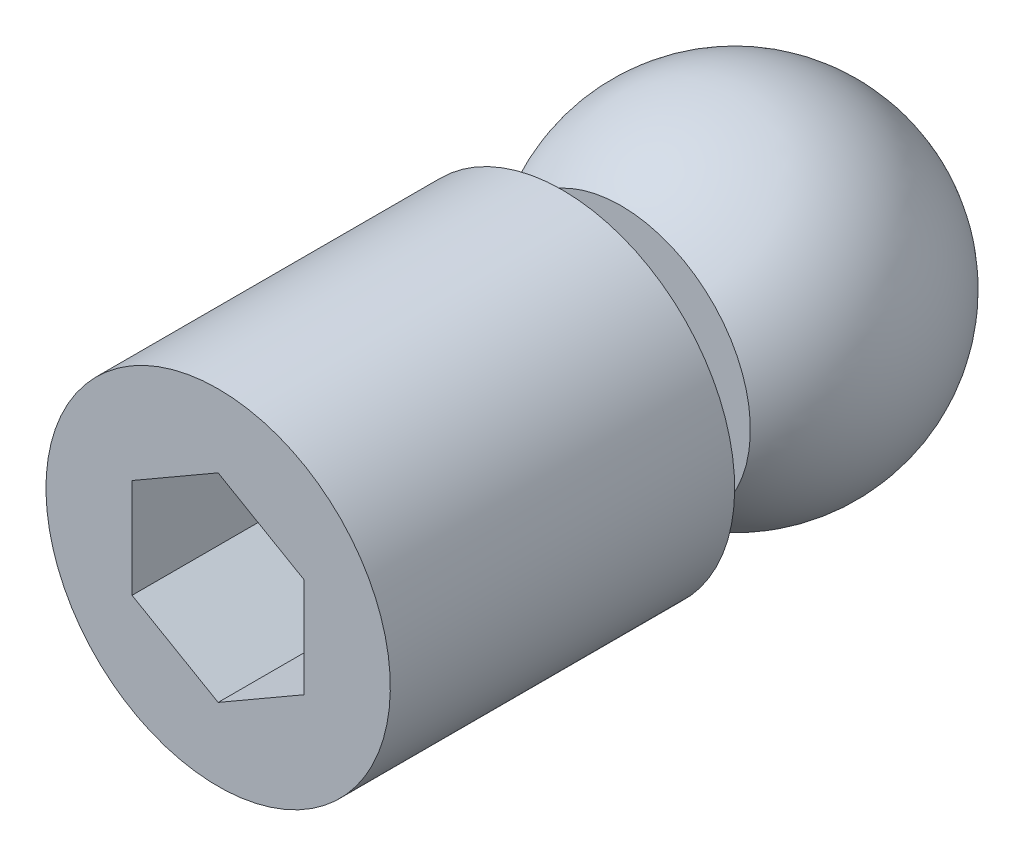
ISO-10303-21;
HEADER;
FILE_DESCRIPTION(('STEP AP214'),'2;1');
FILE_NAME('part.step','',(''),(''),'','','');
FILE_SCHEMA(('AUTOMOTIVE_DESIGN { 1 0 10303 214 1 1 1 1 }'));
ENDSEC;
DATA;
#1=APPLICATION_CONTEXT('core data for automotive mechanical design processes');
#2=APPLICATION_PROTOCOL_DEFINITION('international standard','automotive_design',2000,#1);
#3=PRODUCT_CONTEXT('',#1,'mechanical');
#4=PRODUCT('Part','Part','',(#3));
#5=PRODUCT_RELATED_PRODUCT_CATEGORY('part','',(#4));
#6=PRODUCT_DEFINITION_FORMATION('','',#4);
#7=PRODUCT_DEFINITION_CONTEXT('part definition',#1,'design');
#8=PRODUCT_DEFINITION('design','',#6,#7);
#9=PRODUCT_DEFINITION_SHAPE('','',#8);
#10=(LENGTH_UNIT() NAMED_UNIT(*) SI_UNIT(.MILLI.,.METRE.));
#11=(NAMED_UNIT(*) PLANE_ANGLE_UNIT() SI_UNIT($,.RADIAN.));
#12=(NAMED_UNIT(*) SI_UNIT($,.STERADIAN.) SOLID_ANGLE_UNIT());
#13=UNCERTAINTY_MEASURE_WITH_UNIT(LENGTH_MEASURE(1.E-05),#10,'distance_accuracy_value','');
#14=(GEOMETRIC_REPRESENTATION_CONTEXT(3) GLOBAL_UNCERTAINTY_ASSIGNED_CONTEXT((#13)) GLOBAL_UNIT_ASSIGNED_CONTEXT((#10,
#11,#12)) REPRESENTATION_CONTEXT('',''));
#15=CARTESIAN_POINT('',(0.,0.,0.));
#16=DIRECTION('',(0.,0.,1.));
#17=DIRECTION('',(1.,0.,0.));
#18=AXIS2_PLACEMENT_3D('',#15,#16,#17);
#19=CARTESIAN_POINT('',(0.,0.,5.));
#20=DIRECTION('',(0.,-1.,0.));
#21=DIRECTION('',(-1.,0.,0.));
#22=AXIS2_PLACEMENT_3D('',#19,#20,#21);
#23=SPHERICAL_SURFACE('',#22,5.);
#24=CARTESIAN_POINT('',(0.,0.,5.));
#25=DIRECTION('',(0.,0.,1.));
#26=DIRECTION('',(0.,1.,0.));
#27=AXIS2_PLACEMENT_3D('',#24,#25,#26);
#28=SPHERICAL_SURFACE('',#27,5.);
#29=CARTESIAN_POINT('',(0.,0.,8.3));
#30=DIRECTION('',(0.,0.,1.));
#31=DIRECTION('',(0.,1.,0.));
#32=AXIS2_PLACEMENT_3D('',#29,#30,#31);
#33=CIRCLE('',#32,3.75632799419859);
#34=CARTESIAN_POINT('',(0.,3.75632799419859,8.3));
#35=VERTEX_POINT('',#34);
#36=EDGE_CURVE('E9',#35,#35,#33,.T.);
#37=ORIENTED_EDGE('',*,*,#36,.F.);
#38=EDGE_LOOP('',(#37));
#39=FACE_BOUND('',#38,.T.);
#40=ADVANCED_FACE('F14',(#39),#28,.T.);
#41=CARTESIAN_POINT('',(0.,-3.75632799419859,8.3));
#42=DIRECTION('',(0.,0.,-1.));
#43=DIRECTION('',(0.,-1.,0.));
#44=AXIS2_PLACEMENT_3D('',#41,#42,#43);
#45=PLANE('',#44);
#46=CARTESIAN_POINT('',(0.,0.,8.3));
#47=DIRECTION('',(0.,0.,1.));
#48=DIRECTION('',(0.,1.,0.));
#49=AXIS2_PLACEMENT_3D('',#46,#47,#48);
#50=CIRCLE('',#49,2.5);
#51=CARTESIAN_POINT('',(0.,2.5,8.3));
#52=VERTEX_POINT('',#51);
#53=EDGE_CURVE('E21',#52,#52,#50,.T.);
#54=ORIENTED_EDGE('',*,*,#53,.F.);
#55=EDGE_LOOP('',(#54));
#56=FACE_BOUND('',#55,.T.);
#57=ORIENTED_EDGE('',*,*,#36,.T.);
#58=EDGE_LOOP('',(#57));
#59=FACE_BOUND('',#58,.T.);
#60=ADVANCED_FACE('F134',(#56,#59),#45,.F.);
#61=CARTESIAN_POINT('',(0.,0.,8.3));
#62=DIRECTION('',(0.,0.,1.));
#63=DIRECTION('',(0.,1.,0.));
#64=AXIS2_PLACEMENT_3D('',#61,#62,#63);
#65=CYLINDRICAL_SURFACE('',#64,2.5);
#66=ORIENTED_EDGE('',*,*,#53,.T.);
#67=EDGE_LOOP('',(#66));
#68=FACE_BOUND('',#67,.T.);
#69=CARTESIAN_POINT('',(0.,0.,10.));
#70=DIRECTION('',(0.,0.,1.));
#71=DIRECTION('',(0.,1.,0.));
#72=AXIS2_PLACEMENT_3D('',#69,#70,#71);
#73=CIRCLE('',#72,2.5);
#74=CARTESIAN_POINT('',(0.,2.5,10.));
#75=VERTEX_POINT('',#74);
#76=EDGE_CURVE('E126',#75,#75,#73,.T.);
#77=ORIENTED_EDGE('',*,*,#76,.F.);
#78=EDGE_LOOP('',(#77));
#79=FACE_BOUND('',#78,.T.);
#80=ADVANCED_FACE('F131',(#68,#79),#65,.T.);
#81=CARTESIAN_POINT('',(0.,-5.,10.));
#82=DIRECTION('',(0.,0.,-1.));
#83=DIRECTION('',(0.,-1.,0.));
#84=AXIS2_PLACEMENT_3D('',#81,#82,#83);
#85=PLANE('',#84);
#86=ORIENTED_EDGE('',*,*,#76,.T.);
#87=EDGE_LOOP('',(#86));
#88=FACE_BOUND('',#87,.T.);
#89=CARTESIAN_POINT('',(0.,0.,10.));
#90=DIRECTION('',(0.,0.,1.));
#91=DIRECTION('',(0.,1.,0.));
#92=AXIS2_PLACEMENT_3D('',#89,#90,#91);
#93=CIRCLE('',#92,5.);
#94=CARTESIAN_POINT('',(0.,5.,10.));
#95=VERTEX_POINT('',#94);
#96=EDGE_CURVE('E123',#95,#95,#93,.T.);
#97=ORIENTED_EDGE('',*,*,#96,.F.);
#98=EDGE_LOOP('',(#97));
#99=FACE_BOUND('',#98,.T.);
#100=ADVANCED_FACE('F157',(#88,#99),#85,.T.);
#101=CARTESIAN_POINT('',(0.,0.,8.3));
#102=DIRECTION('',(0.,0.,1.));
#103=DIRECTION('',(0.,1.,0.));
#104=AXIS2_PLACEMENT_3D('',#101,#102,#103);
#105=CYLINDRICAL_SURFACE('',#104,5.);
#106=ORIENTED_EDGE('',*,*,#96,.T.);
#107=EDGE_LOOP('',(#106));
#108=FACE_BOUND('',#107,.T.);
#109=CARTESIAN_POINT('',(0.,0.,20.));
#110=DIRECTION('',(0.,0.,1.));
#111=DIRECTION('',(0.,1.,0.));
#112=AXIS2_PLACEMENT_3D('',#109,#110,#111);
#113=CIRCLE('',#112,5.);
#114=CARTESIAN_POINT('',(0.,5.,20.));
#115=VERTEX_POINT('',#114);
#116=EDGE_CURVE('E115',#115,#115,#113,.T.);
#117=ORIENTED_EDGE('',*,*,#116,.F.);
#118=EDGE_LOOP('',(#117));
#119=FACE_BOUND('',#118,.T.);
#120=ADVANCED_FACE('F165',(#108,#119),#105,.T.);
#121=CARTESIAN_POINT('',(0.,0.,20.));
#122=DIRECTION('',(0.,0.,1.));
#123=DIRECTION('',(0.,1.,0.));
#124=AXIS2_PLACEMENT_3D('',#121,#122,#123);
#125=PLANE('',#124);
#126=DIRECTION('',(-0.866025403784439,0.5,0.));
#127=VECTOR('',#126,1.);
#128=CARTESIAN_POINT('',(2.5,1.44337567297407,20.));
#129=LINE('',#128,#127);
#130=CARTESIAN_POINT('',(2.5,1.44337567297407,20.));
#131=VERTEX_POINT('',#130);
#132=CARTESIAN_POINT('',(0.,2.88675134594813,20.));
#133=VERTEX_POINT('',#132);
#134=EDGE_CURVE('E28',#131,#133,#129,.T.);
#135=ORIENTED_EDGE('',*,*,#134,.F.);
#136=DIRECTION('',(0.,1.,0.));
#137=VECTOR('',#136,1.);
#138=CARTESIAN_POINT('',(2.5,-1.44337567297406,20.));
#139=LINE('',#138,#137);
#140=CARTESIAN_POINT('',(2.5,-1.44337567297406,20.));
#141=VERTEX_POINT('',#140);
#142=EDGE_CURVE('E111',#141,#131,#139,.T.);
#143=ORIENTED_EDGE('',*,*,#142,.F.);
#144=DIRECTION('',(0.866025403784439,0.5,0.));
#145=VECTOR('',#144,1.);
#146=CARTESIAN_POINT('',(0.,-2.88675134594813,20.));
#147=LINE('',#146,#145);
#148=CARTESIAN_POINT('',(0.,-2.88675134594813,20.));
#149=VERTEX_POINT('',#148);
#150=EDGE_CURVE('E109',#149,#141,#147,.T.);
#151=ORIENTED_EDGE('',*,*,#150,.F.);
#152=DIRECTION('',(0.866025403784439,-0.5,0.));
#153=VECTOR('',#152,1.);
#154=CARTESIAN_POINT('',(-2.5,-1.44337567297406,20.));
#155=LINE('',#154,#153);
#156=CARTESIAN_POINT('',(-2.5,-1.44337567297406,20.));
#157=VERTEX_POINT('',#156);
#158=EDGE_CURVE('E76',#157,#149,#155,.T.);
#159=ORIENTED_EDGE('',*,*,#158,.F.);
#160=DIRECTION('',(0.,-1.,0.));
#161=VECTOR('',#160,1.);
#162=CARTESIAN_POINT('',(-2.5,1.44337567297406,20.));
#163=LINE('',#162,#161);
#164=CARTESIAN_POINT('',(-2.5,1.44337567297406,20.));
#165=VERTEX_POINT('',#164);
#166=EDGE_CURVE('E105',#165,#157,#163,.T.);
#167=ORIENTED_EDGE('',*,*,#166,.F.);
#168=DIRECTION('',(-0.866025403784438,-0.5,0.));
#169=VECTOR('',#168,1.);
#170=CARTESIAN_POINT('',(0.,2.88675134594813,20.));
#171=LINE('',#170,#169);
#172=EDGE_CURVE('E102',#133,#165,#171,.T.);
#173=ORIENTED_EDGE('',*,*,#172,.F.);
#174=EDGE_LOOP('',(#135,#143,#151,#159,#167,#173));
#175=FACE_BOUND('',#174,.T.);
#176=ORIENTED_EDGE('',*,*,#116,.T.);
#177=EDGE_LOOP('',(#176));
#178=FACE_BOUND('',#177,.T.);
#179=ADVANCED_FACE('F174',(#175,#178),#125,.T.);
#180=CARTESIAN_POINT('',(2.5,1.44337567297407,14.));
#181=DIRECTION('',(0.5,0.866025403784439,0.));
#182=DIRECTION('',(-0.866025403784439,0.5,0.));
#183=AXIS2_PLACEMENT_3D('',#180,#181,#182);
#184=PLANE('',#183);
#185=ORIENTED_EDGE('',*,*,#134,.T.);
#186=DIRECTION('',(0.,0.,1.));
#187=VECTOR('',#186,1.);
#188=CARTESIAN_POINT('',(0.,2.88675134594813,14.));
#189=LINE('',#188,#187);
#190=CARTESIAN_POINT('',(0.,2.88675134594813,14.));
#191=VERTEX_POINT('',#190);
#192=EDGE_CURVE('E58',#191,#133,#189,.T.);
#193=ORIENTED_EDGE('',*,*,#192,.F.);
#194=DIRECTION('',(-0.866025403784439,0.5,0.));
#195=VECTOR('',#194,1.);
#196=CARTESIAN_POINT('',(2.5,1.44337567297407,14.));
#197=LINE('',#196,#195);
#198=CARTESIAN_POINT('',(2.5,1.44337567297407,14.));
#199=VERTEX_POINT('',#198);
#200=EDGE_CURVE('E113',#199,#191,#197,.T.);
#201=ORIENTED_EDGE('',*,*,#200,.F.);
#202=DIRECTION('',(0.,0.,1.));
#203=VECTOR('',#202,1.);
#204=CARTESIAN_POINT('',(2.5,1.44337567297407,14.));
#205=LINE('',#204,#203);
#206=EDGE_CURVE('E36',#199,#131,#205,.T.);
#207=ORIENTED_EDGE('',*,*,#206,.T.);
#208=EDGE_LOOP('',(#185,#193,#201,#207));
#209=FACE_BOUND('',#208,.T.);
#210=ADVANCED_FACE('F183',(#209),#184,.F.);
#211=CARTESIAN_POINT('',(2.5,-1.44337567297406,14.));
#212=DIRECTION('',(1.,0.,0.));
#213=DIRECTION('',(0.,0.,-1.));
#214=AXIS2_PLACEMENT_3D('',#211,#212,#213);
#215=PLANE('',#214);
#216=ORIENTED_EDGE('',*,*,#142,.T.);
#217=ORIENTED_EDGE('',*,*,#206,.F.);
#218=DIRECTION('',(0.,1.,0.));
#219=VECTOR('',#218,1.);
#220=CARTESIAN_POINT('',(2.5,-1.44337567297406,14.));
#221=LINE('',#220,#219);
#222=CARTESIAN_POINT('',(2.5,-1.44337567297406,14.));
#223=VERTEX_POINT('',#222);
#224=EDGE_CURVE('E88',#223,#199,#221,.T.);
#225=ORIENTED_EDGE('',*,*,#224,.F.);
#226=DIRECTION('',(0.,0.,1.));
#227=VECTOR('',#226,1.);
#228=CARTESIAN_POINT('',(2.5,-1.44337567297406,14.));
#229=LINE('',#228,#227);
#230=EDGE_CURVE('E80',#223,#141,#229,.T.);
#231=ORIENTED_EDGE('',*,*,#230,.T.);
#232=EDGE_LOOP('',(#216,#217,#225,#231));
#233=FACE_BOUND('',#232,.T.);
#234=ADVANCED_FACE('F192',(#233),#215,.F.);
#235=CARTESIAN_POINT('',(0.,-2.88675134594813,14.));
#236=DIRECTION('',(0.5,-0.866025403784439,0.));
#237=DIRECTION('',(0.866025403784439,0.5,0.));
#238=AXIS2_PLACEMENT_3D('',#235,#236,#237);
#239=PLANE('',#238);
#240=ORIENTED_EDGE('',*,*,#150,.T.);
#241=ORIENTED_EDGE('',*,*,#230,.F.);
#242=DIRECTION('',(0.866025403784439,0.5,0.));
#243=VECTOR('',#242,1.);
#244=CARTESIAN_POINT('',(0.,-2.88675134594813,14.));
#245=LINE('',#244,#243);
#246=CARTESIAN_POINT('',(0.,-2.88675134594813,14.));
#247=VERTEX_POINT('',#246);
#248=EDGE_CURVE('E84',#247,#223,#245,.T.);
#249=ORIENTED_EDGE('',*,*,#248,.F.);
#250=DIRECTION('',(0.,0.,1.));
#251=VECTOR('',#250,1.);
#252=CARTESIAN_POINT('',(0.,-2.88675134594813,14.));
#253=LINE('',#252,#251);
#254=EDGE_CURVE('E69',#247,#149,#253,.T.);
#255=ORIENTED_EDGE('',*,*,#254,.T.);
#256=EDGE_LOOP('',(#240,#241,#249,#255));
#257=FACE_BOUND('',#256,.T.);
#258=ADVANCED_FACE('F85',(#257),#239,.F.);
#259=CARTESIAN_POINT('',(-2.5,-1.44337567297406,14.));
#260=DIRECTION('',(-0.5,-0.866025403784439,0.));
#261=DIRECTION('',(0.866025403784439,-0.5,0.));
#262=AXIS2_PLACEMENT_3D('',#259,#260,#261);
#263=PLANE('',#262);
#264=ORIENTED_EDGE('',*,*,#158,.T.);
#265=ORIENTED_EDGE('',*,*,#254,.F.);
#266=DIRECTION('',(0.866025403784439,-0.5,0.));
#267=VECTOR('',#266,1.);
#268=CARTESIAN_POINT('',(-2.5,-1.44337567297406,14.));
#269=LINE('',#268,#267);
#270=CARTESIAN_POINT('',(-2.5,-1.44337567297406,14.));
#271=VERTEX_POINT('',#270);
#272=EDGE_CURVE('E73',#271,#247,#269,.T.);
#273=ORIENTED_EDGE('',*,*,#272,.F.);
#274=DIRECTION('',(0.,0.,1.));
#275=VECTOR('',#274,1.);
#276=CARTESIAN_POINT('',(-2.5,-1.44337567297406,14.));
#277=LINE('',#276,#275);
#278=EDGE_CURVE('E81',#271,#157,#277,.T.);
#279=ORIENTED_EDGE('',*,*,#278,.T.);
#280=EDGE_LOOP('',(#264,#265,#273,#279));
#281=FACE_BOUND('',#280,.T.);
#282=ADVANCED_FACE('F71',(#281),#263,.F.);
#283=CARTESIAN_POINT('',(-2.5,1.44337567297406,14.));
#284=DIRECTION('',(-1.,0.,0.));
#285=DIRECTION('',(0.,0.,1.));
#286=AXIS2_PLACEMENT_3D('',#283,#284,#285);
#287=PLANE('',#286);
#288=ORIENTED_EDGE('',*,*,#166,.T.);
#289=ORIENTED_EDGE('',*,*,#278,.F.);
#290=DIRECTION('',(0.,-1.,0.));
#291=VECTOR('',#290,1.);
#292=CARTESIAN_POINT('',(-2.5,1.44337567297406,14.));
#293=LINE('',#292,#291);
#294=CARTESIAN_POINT('',(-2.5,1.44337567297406,14.));
#295=VERTEX_POINT('',#294);
#296=EDGE_CURVE('E94',#295,#271,#293,.T.);
#297=ORIENTED_EDGE('',*,*,#296,.F.);
#298=DIRECTION('',(0.,0.,1.));
#299=VECTOR('',#298,1.);
#300=CARTESIAN_POINT('',(-2.5,1.44337567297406,14.));
#301=LINE('',#300,#299);
#302=EDGE_CURVE('E118',#295,#165,#301,.T.);
#303=ORIENTED_EDGE('',*,*,#302,.T.);
#304=EDGE_LOOP('',(#288,#289,#297,#303));
#305=FACE_BOUND('',#304,.T.);
#306=ADVANCED_FACE('F214',(#305),#287,.F.);
#307=CARTESIAN_POINT('',(0.,2.88675134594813,14.));
#308=DIRECTION('',(-0.5,0.866025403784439,0.));
#309=DIRECTION('',(-0.866025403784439,-0.5,0.));
#310=AXIS2_PLACEMENT_3D('',#307,#308,#309);
#311=PLANE('',#310);
#312=ORIENTED_EDGE('',*,*,#172,.T.);
#313=ORIENTED_EDGE('',*,*,#302,.F.);
#314=DIRECTION('',(-0.866025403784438,-0.5,0.));
#315=VECTOR('',#314,1.);
#316=CARTESIAN_POINT('',(0.,2.88675134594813,14.));
#317=LINE('',#316,#315);
#318=EDGE_CURVE('E96',#191,#295,#317,.T.);
#319=ORIENTED_EDGE('',*,*,#318,.F.);
#320=ORIENTED_EDGE('',*,*,#192,.T.);
#321=EDGE_LOOP('',(#312,#313,#319,#320));
#322=FACE_BOUND('',#321,.T.);
#323=ADVANCED_FACE('F222',(#322),#311,.F.);
#324=CARTESIAN_POINT('',(0.,2.88675134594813,14.));
#325=DIRECTION('',(0.,0.,1.));
#326=DIRECTION('',(1.,0.,0.));
#327=AXIS2_PLACEMENT_3D('',#324,#325,#326);
#328=PLANE('',#327);
#329=ORIENTED_EDGE('',*,*,#200,.T.);
#330=ORIENTED_EDGE('',*,*,#318,.T.);
#331=ORIENTED_EDGE('',*,*,#296,.T.);
#332=ORIENTED_EDGE('',*,*,#272,.T.);
#333=ORIENTED_EDGE('',*,*,#248,.T.);
#334=ORIENTED_EDGE('',*,*,#224,.T.);
#335=EDGE_LOOP('',(#329,#330,#331,#332,#333,#334));
#336=FACE_BOUND('',#335,.T.);
#337=ADVANCED_FACE('F91',(#336),#328,.T.);
#338=CLOSED_SHELL('',(#40,#60,#80,#100,#120,#179,#210,#234,#258,#282,#306,#323,#337));
#339=MANIFOLD_SOLID_BREP('B1',#338);
#340=ADVANCED_BREP_SHAPE_REPRESENTATION('',(#18,#339),#14);
#341=SHAPE_DEFINITION_REPRESENTATION(#9,#340);
ENDSEC;
END-ISO-10303-21;
